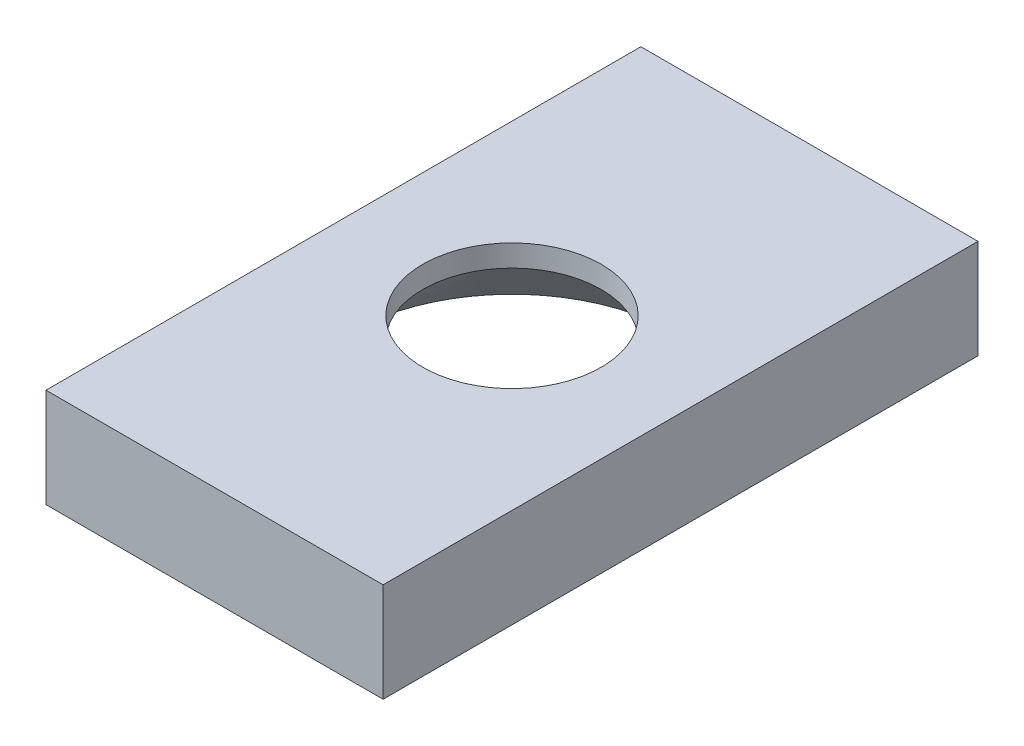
ISO-10303-21;
HEADER;
FILE_DESCRIPTION(('STEP AP214'),'2;1');
FILE_NAME('part.step','',(''),(''),'','','');
FILE_SCHEMA(('AUTOMOTIVE_DESIGN { 1 0 10303 214 1 1 1 1 }'));
ENDSEC;
DATA;
#1=APPLICATION_CONTEXT('core data for automotive mechanical design processes');
#2=APPLICATION_PROTOCOL_DEFINITION('international standard','automotive_design',2000,#1);
#3=PRODUCT_CONTEXT('',#1,'mechanical');
#4=PRODUCT('Part','Part','',(#3));
#5=PRODUCT_RELATED_PRODUCT_CATEGORY('part','',(#4));
#6=PRODUCT_DEFINITION_FORMATION('','',#4);
#7=PRODUCT_DEFINITION_CONTEXT('part definition',#1,'design');
#8=PRODUCT_DEFINITION('design','',#6,#7);
#9=PRODUCT_DEFINITION_SHAPE('','',#8);
#10=(LENGTH_UNIT() NAMED_UNIT(*) SI_UNIT(.MILLI.,.METRE.));
#11=(NAMED_UNIT(*) PLANE_ANGLE_UNIT() SI_UNIT($,.RADIAN.));
#12=(NAMED_UNIT(*) SI_UNIT($,.STERADIAN.) SOLID_ANGLE_UNIT());
#13=UNCERTAINTY_MEASURE_WITH_UNIT(LENGTH_MEASURE(1.E-05),#10,'distance_accuracy_value','');
#14=(GEOMETRIC_REPRESENTATION_CONTEXT(3) GLOBAL_UNCERTAINTY_ASSIGNED_CONTEXT((#13)) GLOBAL_UNIT_ASSIGNED_CONTEXT((#10,
#11,#12)) REPRESENTATION_CONTEXT('',''));
#15=CARTESIAN_POINT('',(0.,0.,0.));
#16=DIRECTION('',(0.,0.,1.));
#17=DIRECTION('',(1.,0.,0.));
#18=AXIS2_PLACEMENT_3D('',#15,#16,#17);
#19=CARTESIAN_POINT('',(-8.5,-2.5,30.));
#20=DIRECTION('',(1.,0.,0.));
#21=DIRECTION('',(0.,0.,-1.));
#22=AXIS2_PLACEMENT_3D('',#19,#20,#21);
#23=PLANE('',#22);
#24=DIRECTION('',(0.,-1.,0.));
#25=VECTOR('',#24,1.);
#26=CARTESIAN_POINT('',(-8.5,-2.5,0.));
#27=LINE('',#26,#25);
#28=CARTESIAN_POINT('',(-8.5,2.5,0.));
#29=VERTEX_POINT('',#28);
#30=CARTESIAN_POINT('',(-8.5,-2.5,0.));
#31=VERTEX_POINT('',#30);
#32=EDGE_CURVE('E73',#29,#31,#27,.T.);
#33=ORIENTED_EDGE('',*,*,#32,.T.);
#34=DIRECTION('',(0.,0.,-1.));
#35=VECTOR('',#34,1.);
#36=CARTESIAN_POINT('',(-8.5,-2.5,30.));
#37=LINE('',#36,#35);
#38=CARTESIAN_POINT('',(-8.5,-2.5,30.));
#39=VERTEX_POINT('',#38);
#40=EDGE_CURVE('E11',#39,#31,#37,.T.);
#41=ORIENTED_EDGE('',*,*,#40,.F.);
#42=DIRECTION('',(0.,-1.,0.));
#43=VECTOR('',#42,1.);
#44=CARTESIAN_POINT('',(-8.5,-2.5,30.));
#45=LINE('',#44,#43);
#46=CARTESIAN_POINT('',(-8.5,2.5,30.));
#47=VERTEX_POINT('',#46);
#48=EDGE_CURVE('E95',#47,#39,#45,.T.);
#49=ORIENTED_EDGE('',*,*,#48,.F.);
#50=DIRECTION('',(0.,0.,-1.));
#51=VECTOR('',#50,1.);
#52=CARTESIAN_POINT('',(-8.5,2.5,30.));
#53=LINE('',#52,#51);
#54=EDGE_CURVE('E85',#47,#29,#53,.T.);
#55=ORIENTED_EDGE('',*,*,#54,.T.);
#56=EDGE_LOOP('',(#33,#41,#49,#55));
#57=FACE_BOUND('',#56,.T.);
#58=ADVANCED_FACE('F28',(#57),#23,.F.);
#59=CARTESIAN_POINT('',(-8.5,-2.5,30.));
#60=DIRECTION('',(0.,1.,0.));
#61=DIRECTION('',(0.,0.,1.));
#62=AXIS2_PLACEMENT_3D('',#59,#60,#61);
#63=PLANE('',#62);
#64=CARTESIAN_POINT('',(0.,-2.5,15.));
#65=DIRECTION('',(0.,-1.,0.));
#66=DIRECTION('',(0.,0.,-1.));
#67=AXIS2_PLACEMENT_3D('',#64,#65,#66);
#68=CIRCLE('',#67,8.4);
#69=CARTESIAN_POINT('',(0.,-2.5,6.6));
#70=VERTEX_POINT('',#69);
#71=EDGE_CURVE('E88',#70,#70,#68,.T.);
#72=ORIENTED_EDGE('',*,*,#71,.F.);
#73=EDGE_LOOP('',(#72));
#74=FACE_BOUND('',#73,.T.);
#75=DIRECTION('',(1.,0.,0.));
#76=VECTOR('',#75,1.);
#77=CARTESIAN_POINT('',(-8.5,-2.5,0.));
#78=LINE('',#77,#76);
#79=CARTESIAN_POINT('',(8.5,-2.5,0.));
#80=VERTEX_POINT('',#79);
#81=EDGE_CURVE('E69',#31,#80,#78,.T.);
#82=ORIENTED_EDGE('',*,*,#81,.T.);
#83=DIRECTION('',(0.,0.,-1.));
#84=VECTOR('',#83,1.);
#85=CARTESIAN_POINT('',(8.5,-2.5,30.));
#86=LINE('',#85,#84);
#87=CARTESIAN_POINT('',(8.5,-2.5,30.));
#88=VERTEX_POINT('',#87);
#89=EDGE_CURVE('E36',#88,#80,#86,.T.);
#90=ORIENTED_EDGE('',*,*,#89,.F.);
#91=DIRECTION('',(1.,0.,0.));
#92=VECTOR('',#91,1.);
#93=CARTESIAN_POINT('',(-8.5,-2.5,30.));
#94=LINE('',#93,#92);
#95=EDGE_CURVE('E81',#39,#88,#94,.T.);
#96=ORIENTED_EDGE('',*,*,#95,.F.);
#97=ORIENTED_EDGE('',*,*,#40,.T.);
#98=EDGE_LOOP('',(#82,#90,#96,#97));
#99=FACE_BOUND('',#98,.T.);
#100=ADVANCED_FACE('F80',(#74,#99),#63,.F.);
#101=CARTESIAN_POINT('',(8.5,-2.5,30.));
#102=DIRECTION('',(-1.,0.,0.));
#103=DIRECTION('',(0.,0.,1.));
#104=AXIS2_PLACEMENT_3D('',#101,#102,#103);
#105=PLANE('',#104);
#106=DIRECTION('',(0.,1.,0.));
#107=VECTOR('',#106,1.);
#108=CARTESIAN_POINT('',(8.5,-2.5,0.));
#109=LINE('',#108,#107);
#110=CARTESIAN_POINT('',(8.5,2.5,0.));
#111=VERTEX_POINT('',#110);
#112=EDGE_CURVE('E74',#80,#111,#109,.T.);
#113=ORIENTED_EDGE('',*,*,#112,.T.);
#114=DIRECTION('',(0.,0.,-1.));
#115=VECTOR('',#114,1.);
#116=CARTESIAN_POINT('',(8.5,2.5,30.));
#117=LINE('',#116,#115);
#118=CARTESIAN_POINT('',(8.5,2.5,30.));
#119=VERTEX_POINT('',#118);
#120=EDGE_CURVE('E101',#119,#111,#117,.T.);
#121=ORIENTED_EDGE('',*,*,#120,.F.);
#122=DIRECTION('',(0.,1.,0.));
#123=VECTOR('',#122,1.);
#124=CARTESIAN_POINT('',(8.5,-2.5,30.));
#125=LINE('',#124,#123);
#126=EDGE_CURVE('E48',#88,#119,#125,.T.);
#127=ORIENTED_EDGE('',*,*,#126,.F.);
#128=ORIENTED_EDGE('',*,*,#89,.T.);
#129=EDGE_LOOP('',(#113,#121,#127,#128));
#130=FACE_BOUND('',#129,.T.);
#131=ADVANCED_FACE('F105',(#130),#105,.F.);
#132=CARTESIAN_POINT('',(-8.5,2.5,30.));
#133=DIRECTION('',(0.,-1.,0.));
#134=DIRECTION('',(0.,0.,-1.));
#135=AXIS2_PLACEMENT_3D('',#132,#133,#134);
#136=PLANE('',#135);
#137=CARTESIAN_POINT('',(0.,2.5,15.));
#138=DIRECTION('',(0.,-1.,0.));
#139=DIRECTION('',(0.,0.,-1.));
#140=AXIS2_PLACEMENT_3D('',#137,#138,#139);
#141=CIRCLE('',#140,4.5);
#142=CARTESIAN_POINT('',(0.,2.5,10.5));
#143=VERTEX_POINT('',#142);
#144=EDGE_CURVE('E31',#143,#143,#141,.T.);
#145=ORIENTED_EDGE('',*,*,#144,.T.);
#146=EDGE_LOOP('',(#145));
#147=FACE_BOUND('',#146,.T.);
#148=DIRECTION('',(-1.,0.,0.));
#149=VECTOR('',#148,1.);
#150=CARTESIAN_POINT('',(-8.5,2.5,0.));
#151=LINE('',#150,#149);
#152=EDGE_CURVE('E93',#111,#29,#151,.T.);
#153=ORIENTED_EDGE('',*,*,#152,.T.);
#154=ORIENTED_EDGE('',*,*,#54,.F.);
#155=DIRECTION('',(-1.,0.,0.));
#156=VECTOR('',#155,1.);
#157=CARTESIAN_POINT('',(-8.5,2.5,30.));
#158=LINE('',#157,#156);
#159=EDGE_CURVE('E43',#119,#47,#158,.T.);
#160=ORIENTED_EDGE('',*,*,#159,.F.);
#161=ORIENTED_EDGE('',*,*,#120,.T.);
#162=EDGE_LOOP('',(#153,#154,#160,#161));
#163=FACE_BOUND('',#162,.T.);
#164=ADVANCED_FACE('F107',(#147,#163),#136,.F.);
#165=CARTESIAN_POINT('',(-8.5,2.5,30.));
#166=DIRECTION('',(0.,0.,-1.));
#167=DIRECTION('',(-1.,0.,0.));
#168=AXIS2_PLACEMENT_3D('',#165,#166,#167);
#169=PLANE('',#168);
#170=ORIENTED_EDGE('',*,*,#48,.T.);
#171=ORIENTED_EDGE('',*,*,#95,.T.);
#172=ORIENTED_EDGE('',*,*,#126,.T.);
#173=ORIENTED_EDGE('',*,*,#159,.T.);
#174=EDGE_LOOP('',(#170,#171,#172,#173));
#175=FACE_BOUND('',#174,.T.);
#176=ADVANCED_FACE('F108',(#175),#169,.F.);
#177=CARTESIAN_POINT('',(-8.5,2.5,0.));
#178=DIRECTION('',(0.,0.,-1.));
#179=DIRECTION('',(-1.,0.,0.));
#180=AXIS2_PLACEMENT_3D('',#177,#178,#179);
#181=PLANE('',#180);
#182=ORIENTED_EDGE('',*,*,#32,.F.);
#183=ORIENTED_EDGE('',*,*,#152,.F.);
#184=ORIENTED_EDGE('',*,*,#112,.F.);
#185=ORIENTED_EDGE('',*,*,#81,.F.);
#186=EDGE_LOOP('',(#182,#183,#184,#185));
#187=FACE_BOUND('',#186,.T.);
#188=ADVANCED_FACE('F70',(#187),#181,.T.);
#189=CARTESIAN_POINT('',(0.,-2.5,15.));
#190=DIRECTION('',(0.,-1.,0.));
#191=DIRECTION('',(0.,0.,-1.));
#192=AXIS2_PLACEMENT_3D('',#189,#190,#191);
#193=CYLINDRICAL_SURFACE('',#192,4.5);
#194=CARTESIAN_POINT('',(0.,1.4,15.));
#195=DIRECTION('',(0.,-1.,0.));
#196=DIRECTION('',(0.,0.,-1.));
#197=AXIS2_PLACEMENT_3D('',#194,#195,#196);
#198=CIRCLE('',#197,4.5);
#199=CARTESIAN_POINT('',(0.,1.4,10.5));
#200=VERTEX_POINT('',#199);
#201=EDGE_CURVE('E131',#200,#200,#198,.T.);
#202=ORIENTED_EDGE('',*,*,#201,.T.);
#203=EDGE_LOOP('',(#202));
#204=FACE_BOUND('',#203,.T.);
#205=ORIENTED_EDGE('',*,*,#144,.F.);
#206=EDGE_LOOP('',(#205));
#207=FACE_BOUND('',#206,.T.);
#208=ADVANCED_FACE('F115',(#204,#207),#193,.F.);
#209=CARTESIAN_POINT('',(0.,-2.5,15.));
#210=DIRECTION('',(0.,-1.,0.));
#211=DIRECTION('',(0.,0.,-1.));
#212=AXIS2_PLACEMENT_3D('',#209,#210,#211);
#213=CONICAL_SURFACE('',#212,8.4,0.785398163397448);
#214=ORIENTED_EDGE('',*,*,#201,.F.);
#215=EDGE_LOOP('',(#214));
#216=FACE_BOUND('',#215,.T.);
#217=ORIENTED_EDGE('',*,*,#71,.T.);
#218=EDGE_LOOP('',(#217));
#219=FACE_BOUND('',#218,.T.);
#220=ADVANCED_FACE('F137',(#216,#219),#213,.F.);
#221=CLOSED_SHELL('',(#58,#100,#131,#164,#176,#188,#208,#220));
#222=MANIFOLD_SOLID_BREP('B2',#221);
#223=ADVANCED_BREP_SHAPE_REPRESENTATION('',(#18,#222),#14);
#224=SHAPE_DEFINITION_REPRESENTATION(#9,#223);
ENDSEC;
END-ISO-10303-21;
